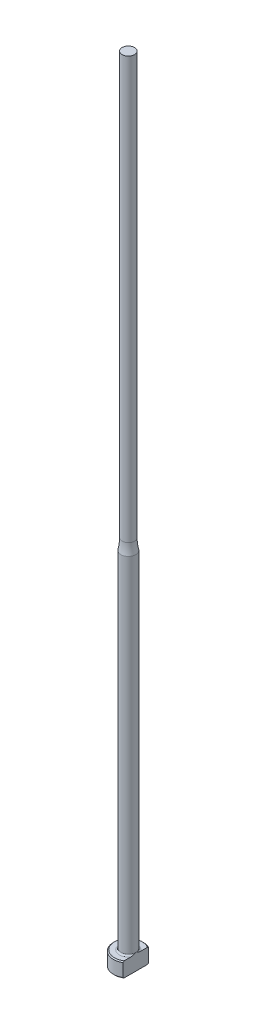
ISO-10303-21;
HEADER;
FILE_DESCRIPTION(('STEP AP214'),'2;1');
FILE_NAME('part.step','',(''),(''),'','','');
FILE_SCHEMA(('AUTOMOTIVE_DESIGN { 1 0 10303 214 1 1 1 1 }'));
ENDSEC;
DATA;
#1=APPLICATION_CONTEXT('core data for automotive mechanical design processes');
#2=APPLICATION_PROTOCOL_DEFINITION('international standard','automotive_design',2000,#1);
#3=PRODUCT_CONTEXT('',#1,'mechanical');
#4=PRODUCT('Part','Part','',(#3));
#5=PRODUCT_RELATED_PRODUCT_CATEGORY('part','',(#4));
#6=PRODUCT_DEFINITION_FORMATION('','',#4);
#7=PRODUCT_DEFINITION_CONTEXT('part definition',#1,'design');
#8=PRODUCT_DEFINITION('design','',#6,#7);
#9=PRODUCT_DEFINITION_SHAPE('','',#8);
#10=(LENGTH_UNIT() NAMED_UNIT(*) SI_UNIT(.MILLI.,.METRE.));
#11=(NAMED_UNIT(*) PLANE_ANGLE_UNIT() SI_UNIT($,.RADIAN.));
#12=(NAMED_UNIT(*) SI_UNIT($,.STERADIAN.) SOLID_ANGLE_UNIT());
#13=UNCERTAINTY_MEASURE_WITH_UNIT(LENGTH_MEASURE(1.E-05),#10,'distance_accuracy_value','');
#14=(GEOMETRIC_REPRESENTATION_CONTEXT(3) GLOBAL_UNCERTAINTY_ASSIGNED_CONTEXT((#13)) GLOBAL_UNIT_ASSIGNED_CONTEXT((#10,
#11,#12)) REPRESENTATION_CONTEXT('',''));
#15=CARTESIAN_POINT('',(0.,0.,0.));
#16=DIRECTION('',(0.,0.,1.));
#17=DIRECTION('',(1.,0.,0.));
#18=AXIS2_PLACEMENT_3D('',#15,#16,#17);
#19=CARTESIAN_POINT('',(-2.99999999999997,3.,0.));
#20=DIRECTION('',(0.,1.,0.));
#21=DIRECTION('',(0.,0.,1.));
#22=AXIS2_PLACEMENT_3D('',#19,#20,#21);
#23=PLANE('',#22);
#24=CARTESIAN_POINT('',(0.,3.,0.));
#25=DIRECTION('',(0.,1.,0.));
#26=DIRECTION('',(0.,0.,1.));
#27=AXIS2_PLACEMENT_3D('',#24,#25,#26);
#28=CIRCLE('',#27,2.79999999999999);
#29=CARTESIAN_POINT('',(1.49999999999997,3.,-2.36431808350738));
#30=VERTEX_POINT('',#29);
#31=CARTESIAN_POINT('',(1.49999999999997,3.,2.36431808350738));
#32=VERTEX_POINT('',#31);
#33=EDGE_CURVE('E187',#30,#32,#28,.T.);
#34=ORIENTED_EDGE('',*,*,#33,.T.);
#35=DIRECTION('',(0.,0.,-1.));
#36=VECTOR('',#35,1.);
#37=CARTESIAN_POINT('',(1.49999999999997,3.,0.));
#38=LINE('',#37,#36);
#39=CARTESIAN_POINT('',(1.49999999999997,3.00000000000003,0.99498743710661));
#40=VERTEX_POINT('',#39);
#41=EDGE_CURVE('E57',#32,#40,#38,.T.);
#42=ORIENTED_EDGE('',*,*,#41,.T.);
#43=CARTESIAN_POINT('',(0.,3.,0.));
#44=DIRECTION('',(0.,1.,0.));
#45=DIRECTION('',(0.,0.,1.));
#46=AXIS2_PLACEMENT_3D('',#43,#44,#45);
#47=CIRCLE('',#46,1.79999999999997);
#48=CARTESIAN_POINT('',(1.49999999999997,3.00000000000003,-0.994987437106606));
#49=VERTEX_POINT('',#48);
#50=EDGE_CURVE('E108',#40,#49,#47,.F.);
#51=ORIENTED_EDGE('',*,*,#50,.T.);
#52=EDGE_CURVE('E137',#49,#30,#38,.T.);
#53=ORIENTED_EDGE('',*,*,#52,.T.);
#54=EDGE_LOOP('',(#34,#42,#51,#53));
#55=FACE_BOUND('',#54,.T.);
#56=ADVANCED_FACE('F32',(#55),#23,.T.);
#57=CARTESIAN_POINT('',(0.,259.958771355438,0.));
#58=DIRECTION('',(0.,1.,0.));
#59=DIRECTION('',(0.,0.,1.));
#60=AXIS2_PLACEMENT_3D('',#57,#58,#59);
#61=CYLINDRICAL_SURFACE('',#60,2.99999999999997);
#62=CARTESIAN_POINT('',(0.,2.80000000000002,0.));
#63=DIRECTION('',(0.,1.,0.));
#64=DIRECTION('',(0.,0.,1.));
#65=AXIS2_PLACEMENT_3D('',#62,#63,#64);
#66=CIRCLE('',#65,2.99999999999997);
#67=CARTESIAN_POINT('',(1.49999999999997,2.80000000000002,2.5980762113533));
#68=VERTEX_POINT('',#67);
#69=CARTESIAN_POINT('',(1.49999999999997,2.80000000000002,-2.5980762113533));
#70=VERTEX_POINT('',#69);
#71=EDGE_CURVE('E105',#68,#70,#66,.F.);
#72=ORIENTED_EDGE('',*,*,#71,.T.);
#73=DIRECTION('',(0.,-1.,0.));
#74=VECTOR('',#73,1.);
#75=CARTESIAN_POINT('',(1.49999999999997,160.,-2.5980762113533));
#76=LINE('',#75,#74);
#77=CARTESIAN_POINT('',(1.49999999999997,0.200000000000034,-2.5980762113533));
#78=VERTEX_POINT('',#77);
#79=EDGE_CURVE('E193',#70,#78,#76,.T.);
#80=ORIENTED_EDGE('',*,*,#79,.T.);
#81=CARTESIAN_POINT('',(0.,0.200000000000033,0.));
#82=DIRECTION('',(0.,-1.,0.));
#83=DIRECTION('',(0.,0.,-1.));
#84=AXIS2_PLACEMENT_3D('',#81,#82,#83);
#85=CIRCLE('',#84,2.99999999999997);
#86=CARTESIAN_POINT('',(1.49999999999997,0.200000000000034,2.5980762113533));
#87=VERTEX_POINT('',#86);
#88=EDGE_CURVE('E100',#78,#87,#85,.F.);
#89=ORIENTED_EDGE('',*,*,#88,.T.);
#90=DIRECTION('',(0.,-1.,0.));
#91=VECTOR('',#90,1.);
#92=CARTESIAN_POINT('',(1.49999999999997,160.,2.5980762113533));
#93=LINE('',#92,#91);
#94=EDGE_CURVE('E93',#68,#87,#93,.T.);
#95=ORIENTED_EDGE('',*,*,#94,.F.);
#96=EDGE_LOOP('',(#72,#80,#89,#95));
#97=FACE_BOUND('',#96,.T.);
#98=ADVANCED_FACE('F158',(#97),#61,.T.);
#99=CARTESIAN_POINT('',(0.,0.,0.));
#100=DIRECTION('',(0.,-1.,0.));
#101=DIRECTION('',(0.,0.,-1.));
#102=AXIS2_PLACEMENT_3D('',#99,#100,#101);
#103=PLANE('',#102);
#104=CARTESIAN_POINT('',(0.,0.,0.));
#105=DIRECTION('',(0.,-1.,0.));
#106=DIRECTION('',(0.,0.,-1.));
#107=AXIS2_PLACEMENT_3D('',#104,#105,#106);
#108=CIRCLE('',#107,2.79999999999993);
#109=CARTESIAN_POINT('',(1.49999999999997,0.,2.36431808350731));
#110=VERTEX_POINT('',#109);
#111=CARTESIAN_POINT('',(1.49999999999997,0.,-2.36431808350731));
#112=VERTEX_POINT('',#111);
#113=EDGE_CURVE('E98',#110,#112,#108,.T.);
#114=ORIENTED_EDGE('',*,*,#113,.T.);
#115=DIRECTION('',(0.,0.,1.));
#116=VECTOR('',#115,1.);
#117=CARTESIAN_POINT('',(1.49999999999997,0.,-2.5980762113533));
#118=LINE('',#117,#116);
#119=EDGE_CURVE('E83',#112,#110,#118,.T.);
#120=ORIENTED_EDGE('',*,*,#119,.T.);
#121=EDGE_LOOP('',(#114,#120));
#122=FACE_BOUND('',#121,.T.);
#123=ADVANCED_FACE('F103',(#122),#103,.T.);
#124=CARTESIAN_POINT('',(0.,3.,0.));
#125=DIRECTION('',(0.,-1.,0.));
#126=DIRECTION('',(0.,0.,-1.));
#127=AXIS2_PLACEMENT_3D('',#124,#125,#126);
#128=CONICAL_SURFACE('',#127,2.79999999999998,0.785398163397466);
#129=ORIENTED_EDGE('',*,*,#71,.F.);
#130=CARTESIAN_POINT('',(1.49999999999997,-0.111741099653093,5.71827621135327));
#131=CARTESIAN_POINT('',(1.49999999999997,0.0136183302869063,5.58866816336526));
#132=CARTESIAN_POINT('',(1.49999999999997,0.138843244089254,5.45892957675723));
#133=CARTESIAN_POINT('',(1.49999999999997,0.388944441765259,5.19911365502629));
#134=CARTESIAN_POINT('',(1.49999999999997,0.513820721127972,5.06903631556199));
#135=CARTESIAN_POINT('',(1.49999999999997,0.763205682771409,4.80840180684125));
#136=CARTESIAN_POINT('',(1.49999999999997,0.887714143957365,4.67784442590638));
#137=CARTESIAN_POINT('',(1.49999999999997,1.13618059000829,4.41620813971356));
#138=CARTESIAN_POINT('',(1.49999999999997,1.26013857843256,4.28512923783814));
#139=CARTESIAN_POINT('',(1.49999999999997,1.50488975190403,4.02490837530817));
#140=CARTESIAN_POINT('',(1.49999999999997,1.6256969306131,3.89577958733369));
#141=CARTESIAN_POINT('',(1.49999999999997,1.86640694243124,3.63668213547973));
#142=CARTESIAN_POINT('',(1.49999999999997,1.98630978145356,3.50671347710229));
#143=CARTESIAN_POINT('',(1.49999999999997,2.22486033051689,3.24567921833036));
#144=CARTESIAN_POINT('',(1.49999999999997,2.34350830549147,3.11461386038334));
#145=CARTESIAN_POINT('',(1.49999999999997,2.57907716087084,2.85094268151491));
#146=CARTESIAN_POINT('',(1.49999999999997,2.69599811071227,2.71833692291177));
#147=CARTESIAN_POINT('',(1.49999999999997,2.88262371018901,2.50255231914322));
#148=CARTESIAN_POINT('',(1.49999999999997,2.95312454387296,2.42006293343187));
#149=CARTESIAN_POINT('',(1.49999999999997,3.0928709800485,2.25401084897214));
#150=CARTESIAN_POINT('',(1.49999999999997,3.16211645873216,2.17044804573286));
#151=CARTESIAN_POINT('',(1.49999999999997,3.29964684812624,2.00105967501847));
#152=CARTESIAN_POINT('',(1.49999999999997,3.36791386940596,1.91521952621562));
#153=CARTESIAN_POINT('',(1.49999999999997,3.50205840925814,1.74171392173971));
#154=CARTESIAN_POINT('',(1.49999999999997,3.56793649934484,1.65404891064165));
#155=CARTESIAN_POINT('',(1.49999999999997,3.69728151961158,1.47490236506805));
#156=CARTESIAN_POINT('',(1.49999999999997,3.76069661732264,1.38338308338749));
#157=CARTESIAN_POINT('',(1.49999999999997,3.8823953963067,1.19675661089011));
#158=CARTESIAN_POINT('',(1.49999999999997,3.94067201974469,1.10164473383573));
#159=CARTESIAN_POINT('',(1.49999999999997,4.04841325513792,0.908008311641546));
#160=CARTESIAN_POINT('',(1.49999999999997,4.0979780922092,0.809540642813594));
#161=CARTESIAN_POINT('',(1.49999999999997,4.18432188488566,0.607192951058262));
#162=CARTESIAN_POINT('',(1.49999999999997,4.22114374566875,0.503332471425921));
#163=CARTESIAN_POINT('',(1.49999999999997,4.26099935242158,0.347577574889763));
#164=CARTESIAN_POINT('',(1.49999999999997,4.27157029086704,0.297609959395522));
#165=CARTESIAN_POINT('',(1.49999999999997,4.28794860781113,0.196885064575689));
#166=CARTESIAN_POINT('',(1.49999999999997,4.29375640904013,0.146127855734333));
#167=CARTESIAN_POINT('',(1.49999999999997,4.30019707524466,0.0444388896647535));
#168=CARTESIAN_POINT('',(1.49999999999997,4.30084594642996,-0.00649183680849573));
#169=CARTESIAN_POINT('',(1.49999999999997,4.29696416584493,-0.108155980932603));
#170=CARTESIAN_POINT('',(1.49999999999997,4.29243308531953,-0.15888938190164));
#171=CARTESIAN_POINT('',(1.49999999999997,4.27856915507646,-0.259234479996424));
#172=CARTESIAN_POINT('',(1.49999999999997,4.26927821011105,-0.30885208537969));
#173=CARTESIAN_POINT('',(1.49999999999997,4.24647108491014,-0.407110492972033));
#174=CARTESIAN_POINT('',(1.49999999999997,4.2329532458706,-0.455750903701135));
#175=CARTESIAN_POINT('',(1.49999999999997,4.20226175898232,-0.552149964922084));
#176=CARTESIAN_POINT('',(1.49999999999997,4.18506801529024,-0.599902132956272));
#177=CARTESIAN_POINT('',(1.49999999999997,4.14771387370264,-0.694205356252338));
#178=CARTESIAN_POINT('',(1.49999999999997,4.1275540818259,-0.740756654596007));
#179=CARTESIAN_POINT('',(1.49999999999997,4.06327696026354,-0.879166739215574));
#180=CARTESIAN_POINT('',(1.49999999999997,4.01551721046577,-0.969329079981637));
#181=CARTESIAN_POINT('',(1.49999999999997,3.91367909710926,-1.1460431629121));
#182=CARTESIAN_POINT('',(1.49999999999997,3.85959300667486,-1.23259031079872));
#183=CARTESIAN_POINT('',(1.49999999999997,3.74697968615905,-1.40321348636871));
#184=CARTESIAN_POINT('',(1.49999999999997,3.68843573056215,-1.48727838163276));
#185=CARTESIAN_POINT('',(1.49999999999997,3.56843845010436,-1.65322187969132));
#186=CARTESIAN_POINT('',(1.49999999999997,3.50698656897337,-1.73510153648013));
#187=CARTESIAN_POINT('',(1.49999999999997,3.38115673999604,-1.89829823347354));
#188=CARTESIAN_POINT('',(1.49999999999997,3.31675092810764,-1.97959369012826));
#189=CARTESIAN_POINT('',(1.49999999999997,3.18634068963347,-2.14090082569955));
#190=CARTESIAN_POINT('',(1.49999999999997,3.12033609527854,-2.22091236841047));
#191=CARTESIAN_POINT('',(1.49999999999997,2.92086431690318,-2.45906508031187));
#192=CARTESIAN_POINT('',(1.49999999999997,2.78562663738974,-2.61572090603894));
#193=CARTESIAN_POINT('',(1.49999999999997,2.53554498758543,-2.90006295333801));
#194=CARTESIAN_POINT('',(1.49999999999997,2.42114543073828,-3.02814382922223));
#195=CARTESIAN_POINT('',(1.49999999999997,2.19093557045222,-3.28303767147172));
#196=CARTESIAN_POINT('',(1.49999999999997,2.07512522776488,-3.40985060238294));
#197=CARTESIAN_POINT('',(1.49999999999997,1.72597067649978,-3.7891384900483));
#198=CARTESIAN_POINT('',(1.49999999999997,1.49111760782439,-4.04022177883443));
#199=CARTESIAN_POINT('',(1.49999999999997,1.02882478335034,-4.52992803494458));
#200=CARTESIAN_POINT('',(1.49999999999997,0.801477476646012,-4.76863870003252));
#201=CARTESIAN_POINT('',(1.49999999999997,0.459548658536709,-5.12558036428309));
#202=CARTESIAN_POINT('',(1.49999999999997,0.345484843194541,-5.2443077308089));
#203=CARTESIAN_POINT('',(1.49999999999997,0.117071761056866,-5.48148573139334));
#204=CARTESIAN_POINT('',(1.49999999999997,0.00272249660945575,-5.59993636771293));
#205=CARTESIAN_POINT('',(1.49999999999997,-0.111741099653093,-5.71827621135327));
#206=B_SPLINE_CURVE_WITH_KNOTS('',3,(#130,#131,#132,#133,#134,#135,#136,#137,#138,#139,#140,
#141,#142,#143,#144,#145,#146,#147,#148,#149,#150,#151,#152,#153,#154,#155,#156,#157,#158,#159,
#160,#161,#162,#163,#164,#165,#166,#167,#168,#169,#170,#171,#172,#173,#174,#175,#176,#177,#178,
#179,#180,#181,#182,#183,#184,#185,#186,#187,#188,#189,#190,#191,#192,#193,#194,#195,#196,#197,
#198,#199,#200,#201,#202,#203,#204,#205),.UNSPECIFIED.,.F.,.F.,(4,2,2,2,2,2,2,2,2,2,2,2,2,2,2,2,
2,2,2,2,2,2,2,2,2,2,2,2,2,2,2,2,2,2,2,2,2,4),(0.,0.540943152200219,1.08189327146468,
1.62312052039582,2.16434426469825,2.69482920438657,3.22531067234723,3.75567781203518,
4.2860235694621,4.61155053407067,4.93710943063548,5.2661094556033,5.59503024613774,
5.92894782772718,6.26331713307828,6.59354403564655,6.92264800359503,7.0756747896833,
7.22868799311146,7.38122626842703,7.53377717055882,7.68500755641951,7.83629736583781,
7.98843643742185,8.14054446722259,8.44618799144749,8.75220879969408,9.05944044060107,
9.36652111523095,9.67764287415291,9.98879742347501,10.6095925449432,11.1247803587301,
11.6399825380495,12.6713544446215,13.6603005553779,14.1542238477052,14.6481430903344),.UNSPECIFIED.);
#207=EDGE_CURVE('E136',#68,#32,#206,.T.);
#208=ORIENTED_EDGE('',*,*,#207,.T.);
#209=ORIENTED_EDGE('',*,*,#33,.F.);
#210=EDGE_CURVE('E128',#30,#70,#206,.T.);
#211=ORIENTED_EDGE('',*,*,#210,.T.);
#212=EDGE_LOOP('',(#129,#208,#209,#211));
#213=FACE_BOUND('',#212,.T.);
#214=ADVANCED_FACE('F144',(#213),#128,.T.);
#215=CARTESIAN_POINT('',(0.,0.200000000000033,0.));
#216=DIRECTION('',(0.,1.,0.));
#217=DIRECTION('',(0.,0.,1.));
#218=AXIS2_PLACEMENT_3D('',#215,#216,#217);
#219=CONICAL_SURFACE('',#218,2.99999999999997,0.785398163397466);
#220=ORIENTED_EDGE('',*,*,#88,.F.);
#221=CARTESIAN_POINT('',(1.49999999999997,3.11174109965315,-5.71827621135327));
#222=CARTESIAN_POINT('',(1.49999999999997,2.98638166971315,-5.58866816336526));
#223=CARTESIAN_POINT('',(1.49999999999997,2.8611567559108,-5.45892957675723));
#224=CARTESIAN_POINT('',(1.49999999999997,2.6110555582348,-5.19911365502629));
#225=CARTESIAN_POINT('',(1.49999999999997,2.48617927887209,-5.06903631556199));
#226=CARTESIAN_POINT('',(1.49999999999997,2.23679431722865,-4.80840180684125));
#227=CARTESIAN_POINT('',(1.49999999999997,2.11228585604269,-4.67784442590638));
#228=CARTESIAN_POINT('',(1.49999999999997,1.86381940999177,-4.41620813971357));
#229=CARTESIAN_POINT('',(1.49999999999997,1.7398614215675,-4.28512923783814));
#230=CARTESIAN_POINT('',(1.49999999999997,1.49511024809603,-4.02490837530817));
#231=CARTESIAN_POINT('',(1.49999999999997,1.37430306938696,-3.89577958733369));
#232=CARTESIAN_POINT('',(1.49999999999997,1.13359305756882,-3.63668213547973));
#233=CARTESIAN_POINT('',(1.49999999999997,1.0136902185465,-3.50671347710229));
#234=CARTESIAN_POINT('',(1.49999999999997,0.775139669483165,-3.24567921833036));
#235=CARTESIAN_POINT('',(1.49999999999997,0.656491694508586,-3.11461386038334));
#236=CARTESIAN_POINT('',(1.49999999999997,0.420922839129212,-2.85094268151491));
#237=CARTESIAN_POINT('',(1.49999999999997,0.304001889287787,-2.71833692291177));
#238=CARTESIAN_POINT('',(1.49999999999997,0.117376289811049,-2.50255231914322));
#239=CARTESIAN_POINT('',(1.49999999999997,0.0468754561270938,-2.42006293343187));
#240=CARTESIAN_POINT('',(1.49999999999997,-0.0928709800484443,-2.25401084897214));
#241=CARTESIAN_POINT('',(1.49999999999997,-0.162116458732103,-2.17044804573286));
#242=CARTESIAN_POINT('',(1.49999999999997,-0.299646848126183,-2.00105967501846));
#243=CARTESIAN_POINT('',(1.49999999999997,-0.367913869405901,-1.91521952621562));
#244=CARTESIAN_POINT('',(1.49999999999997,-0.502058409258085,-1.74171392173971));
#245=CARTESIAN_POINT('',(1.49999999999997,-0.567936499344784,-1.65404891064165));
#246=CARTESIAN_POINT('',(1.49999999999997,-0.697281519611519,-1.47490236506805));
#247=CARTESIAN_POINT('',(1.49999999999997,-0.760696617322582,-1.38338308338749));
#248=CARTESIAN_POINT('',(1.49999999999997,-0.882395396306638,-1.19675661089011));
#249=CARTESIAN_POINT('',(1.49999999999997,-0.940672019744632,-1.10164473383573));
#250=CARTESIAN_POINT('',(1.49999999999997,-1.04841325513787,-0.908008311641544));
#251=CARTESIAN_POINT('',(1.49999999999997,-1.09797809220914,-0.809540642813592));
#252=CARTESIAN_POINT('',(1.49999999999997,-1.1843218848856,-0.60719295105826));
#253=CARTESIAN_POINT('',(1.49999999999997,-1.22114374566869,-0.503332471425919));
#254=CARTESIAN_POINT('',(1.49999999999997,-1.26099935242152,-0.347577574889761));
#255=CARTESIAN_POINT('',(1.49999999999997,-1.27157029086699,-0.29760995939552));
#256=CARTESIAN_POINT('',(1.49999999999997,-1.28794860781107,-0.196885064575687));
#257=CARTESIAN_POINT('',(1.49999999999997,-1.29375640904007,-0.146127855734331));
#258=CARTESIAN_POINT('',(1.49999999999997,-1.30019707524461,-0.0444388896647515));
#259=CARTESIAN_POINT('',(1.49999999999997,-1.3008459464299,0.00649183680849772));
#260=CARTESIAN_POINT('',(1.49999999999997,-1.29696416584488,0.108155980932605));
#261=CARTESIAN_POINT('',(1.49999999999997,-1.29243308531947,0.158889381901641));
#262=CARTESIAN_POINT('',(1.49999999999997,-1.2785691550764,0.259234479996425));
#263=CARTESIAN_POINT('',(1.49999999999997,-1.26927821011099,0.308852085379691));
#264=CARTESIAN_POINT('',(1.49999999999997,-1.24647108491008,0.407110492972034));
#265=CARTESIAN_POINT('',(1.49999999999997,-1.23295324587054,0.455750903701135));
#266=CARTESIAN_POINT('',(1.49999999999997,-1.20226175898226,0.552149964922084));
#267=CARTESIAN_POINT('',(1.49999999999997,-1.18506801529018,0.599902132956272));
#268=CARTESIAN_POINT('',(1.49999999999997,-1.14771387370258,0.694205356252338));
#269=CARTESIAN_POINT('',(1.49999999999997,-1.12755408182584,0.740756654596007));
#270=CARTESIAN_POINT('',(1.49999999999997,-1.06327696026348,0.879166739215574));
#271=CARTESIAN_POINT('',(1.49999999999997,-1.01551721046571,0.969329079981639));
#272=CARTESIAN_POINT('',(1.49999999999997,-0.913679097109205,1.1460431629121));
#273=CARTESIAN_POINT('',(1.49999999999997,-0.8595930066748,1.23259031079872));
#274=CARTESIAN_POINT('',(1.49999999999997,-0.746979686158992,1.40321348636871));
#275=CARTESIAN_POINT('',(1.49999999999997,-0.688435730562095,1.48727838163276));
#276=CARTESIAN_POINT('',(1.49999999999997,-0.568438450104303,1.65322187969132));
#277=CARTESIAN_POINT('',(1.49999999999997,-0.506986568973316,1.73510153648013));
#278=CARTESIAN_POINT('',(1.49999999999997,-0.381156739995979,1.89829823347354));
#279=CARTESIAN_POINT('',(1.49999999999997,-0.316750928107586,1.97959369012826));
#280=CARTESIAN_POINT('',(1.49999999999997,-0.186340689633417,2.14090082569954));
#281=CARTESIAN_POINT('',(1.49999999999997,-0.120336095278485,2.22091236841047));
#282=CARTESIAN_POINT('',(1.49999999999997,0.0791356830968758,2.45906508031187));
#283=CARTESIAN_POINT('',(1.49999999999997,0.214373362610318,2.61572090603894));
#284=CARTESIAN_POINT('',(1.49999999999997,0.46445501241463,2.90006295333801));
#285=CARTESIAN_POINT('',(1.49999999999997,0.578854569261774,3.02814382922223));
#286=CARTESIAN_POINT('',(1.49999999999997,0.809064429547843,3.28303767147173));
#287=CARTESIAN_POINT('',(1.49999999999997,0.924874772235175,3.40985060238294));
#288=CARTESIAN_POINT('',(1.49999999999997,1.27402932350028,3.78913849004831));
#289=CARTESIAN_POINT('',(1.49999999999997,1.50888239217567,4.04022177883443));
#290=CARTESIAN_POINT('',(1.49999999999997,1.97117521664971,4.52992803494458));
#291=CARTESIAN_POINT('',(1.49999999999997,2.19852252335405,4.76863870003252));
#292=CARTESIAN_POINT('',(1.49999999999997,2.54045134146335,5.12558036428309));
#293=CARTESIAN_POINT('',(1.49999999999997,2.65451515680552,5.2443077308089));
#294=CARTESIAN_POINT('',(1.49999999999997,2.88292823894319,5.48148573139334));
#295=CARTESIAN_POINT('',(1.49999999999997,2.9972775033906,5.59993636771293));
#296=CARTESIAN_POINT('',(1.49999999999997,3.11174109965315,5.71827621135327));
#297=B_SPLINE_CURVE_WITH_KNOTS('',3,(#221,#222,#223,#224,#225,#226,#227,#228,#229,#230,#231,
#232,#233,#234,#235,#236,#237,#238,#239,#240,#241,#242,#243,#244,#245,#246,#247,#248,#249,#250,
#251,#252,#253,#254,#255,#256,#257,#258,#259,#260,#261,#262,#263,#264,#265,#266,#267,#268,#269,
#270,#271,#272,#273,#274,#275,#276,#277,#278,#279,#280,#281,#282,#283,#284,#285,#286,#287,#288,
#289,#290,#291,#292,#293,#294,#295,#296),.UNSPECIFIED.,.F.,.F.,(4,2,2,2,2,2,2,2,2,2,2,2,2,2,2,2,
2,2,2,2,2,2,2,2,2,2,2,2,2,2,2,2,2,2,2,2,2,4),(0.,0.540943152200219,1.08189327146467,
1.62312052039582,2.16434426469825,2.69482920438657,3.22531067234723,3.75567781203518,
4.28602356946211,4.61155053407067,4.93710943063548,5.2661094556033,5.59503024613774,
5.92894782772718,6.26331713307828,6.59354403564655,6.92264800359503,7.0756747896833,
7.22868799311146,7.38122626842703,7.53377717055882,7.68500755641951,7.83629736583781,
7.98843643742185,8.14054446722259,8.4461879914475,8.75220879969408,9.05944044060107,
9.36652111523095,9.6776428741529,9.98879742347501,10.6095925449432,11.1247803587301,
11.6399825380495,12.6713544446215,13.6603005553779,14.1542238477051,14.6481430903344),.UNSPECIFIED.);
#298=EDGE_CURVE('E86',#78,#112,#297,.T.);
#299=ORIENTED_EDGE('',*,*,#298,.T.);
#300=ORIENTED_EDGE('',*,*,#113,.F.);
#301=EDGE_CURVE('E89',#110,#87,#297,.T.);
#302=ORIENTED_EDGE('',*,*,#301,.T.);
#303=EDGE_LOOP('',(#220,#299,#300,#302));
#304=FACE_BOUND('',#303,.T.);
#305=ADVANCED_FACE('F97',(#304),#219,.T.);
#306=CARTESIAN_POINT('',(0.,3.30000000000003,0.));
#307=DIRECTION('',(0.,1.,0.));
#308=DIRECTION('',(0.,0.,1.));
#309=AXIS2_PLACEMENT_3D('',#306,#307,#308);
#310=TOROIDAL_SURFACE('',#309,1.79999999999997,0.3);
#311=CARTESIAN_POINT('',(1.49999999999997,3.30000000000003,0.));
#312=CARTESIAN_POINT('',(1.49999999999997,3.300000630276,3.41555678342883E-12));
#313=CARTESIAN_POINT('',(1.49999999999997,3.30000126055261,-1.15373640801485E-07));
#314=CARTESIAN_POINT('',(1.49999999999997,3.3000024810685,-4.90631575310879E-07));
#315=CARTESIAN_POINT('',(1.49999999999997,3.30000307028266,-7.53296670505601E-07));
#316=CARTESIAN_POINT('',(1.49999999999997,3.30000424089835,-1.38757096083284E-06));
#317=CARTESIAN_POINT('',(1.49999999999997,3.300004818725,-1.76563001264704E-06));
#318=CARTESIAN_POINT('',(1.49999999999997,3.30000591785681,-2.58768006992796E-06));
#319=CARTESIAN_POINT('',(1.49999999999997,3.30000643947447,-3.03127014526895E-06));
#320=CARTESIAN_POINT('',(1.49999999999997,3.30000815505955,-4.60021967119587E-06));
#321=CARTESIAN_POINT('',(1.49999999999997,3.30000927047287,-5.8124152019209E-06));
#322=CARTESIAN_POINT('',(1.49999999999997,3.30001128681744,-8.33989413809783E-06));
#323=CARTESIAN_POINT('',(1.49999999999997,3.30001219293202,-9.65128157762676E-06));
#324=CARTESIAN_POINT('',(1.49999999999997,3.30001551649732,-1.46782505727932E-05));
#325=CARTESIAN_POINT('',(1.49999999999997,3.30001775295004,-1.8517976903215E-05));
#326=CARTESIAN_POINT('',(1.49999999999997,3.30002148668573,-2.61616194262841E-05));
#327=CARTESIAN_POINT('',(1.49999999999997,3.30002302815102,-2.99447742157E-05));
#328=CARTESIAN_POINT('',(1.49999999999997,3.30002943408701,-4.58003743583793E-05));
#329=CARTESIAN_POINT('',(1.49999999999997,3.3000341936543,-5.79079078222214E-05));
#330=CARTESIAN_POINT('',(1.49999999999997,3.30004197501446,-8.07263755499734E-05));
#331=CARTESIAN_POINT('',(1.49999999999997,3.30004514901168,-9.13834709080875E-05));
#332=CARTESIAN_POINT('',(1.49999999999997,3.30006989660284,-0.000167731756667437));
#333=CARTESIAN_POINT('',(1.49999999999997,3.30010092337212,-0.000229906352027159));
#334=CARTESIAN_POINT('',(1.49999999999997,3.30021632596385,-0.000470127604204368));
#335=CARTESIAN_POINT('',(1.49999999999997,3.30029368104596,-0.000650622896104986));
#336=CARTESIAN_POINT('',(1.49999999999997,3.30059619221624,-0.00134589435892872));
#337=CARTESIAN_POINT('',(1.49999999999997,3.30082870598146,-0.00185814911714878));
#338=CARTESIAN_POINT('',(1.49999999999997,3.30176696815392,-0.00393547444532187));
#339=CARTESIAN_POINT('',(1.49999999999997,3.30246445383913,-0.00550332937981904));
#340=CARTESIAN_POINT('',(1.49999999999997,3.31426785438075,-0.0320229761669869));
#341=CARTESIAN_POINT('',(1.49999999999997,3.32544800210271,-0.0569503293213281));
#342=CARTESIAN_POINT('',(1.49999999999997,3.34725700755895,-0.105984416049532));
#343=CARTESIAN_POINT('',(1.49999999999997,3.35789134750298,-0.130088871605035));
#344=CARTESIAN_POINT('',(1.49999999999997,3.38015321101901,-0.181096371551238));
#345=CARTESIAN_POINT('',(1.49999999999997,3.39175804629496,-0.208009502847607));
#346=CARTESIAN_POINT('',(1.49999999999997,3.41469034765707,-0.262264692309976));
#347=CARTESIAN_POINT('',(1.49999999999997,3.42601398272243,-0.289608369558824));
#348=CARTESIAN_POINT('',(1.49999999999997,3.45363212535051,-0.35820378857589));
#349=CARTESIAN_POINT('',(1.49999999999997,3.46959026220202,-0.39959288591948));
#350=CARTESIAN_POINT('',(1.49999999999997,3.49940505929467,-0.482097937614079));
#351=CARTESIAN_POINT('',(1.49999999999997,3.51330033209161,-0.523199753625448));
#352=CARTESIAN_POINT('',(1.49999999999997,3.53552507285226,-0.595497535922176));
#353=CARTESIAN_POINT('',(1.49999999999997,3.54436834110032,-0.626532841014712));
#354=CARTESIAN_POINT('',(1.49999999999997,3.56052427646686,-0.6891760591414));
#355=CARTESIAN_POINT('',(1.49999999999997,3.5678279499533,-0.720786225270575));
#356=CARTESIAN_POINT('',(1.49999999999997,3.5875075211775,-0.819524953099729));
#357=CARTESIAN_POINT('',(1.49999999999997,3.59661044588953,-0.88742909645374));
#358=CARTESIAN_POINT('',(1.49999999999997,3.60059842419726,-0.991180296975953));
#359=CARTESIAN_POINT('',(1.49999999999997,3.60019840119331,-1.02684364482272));
#360=CARTESIAN_POINT('',(1.49999999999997,3.59497085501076,-1.097505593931));
#361=CARTESIAN_POINT('',(1.49999999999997,3.59019295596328,-1.13250716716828));
#362=CARTESIAN_POINT('',(1.49999999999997,3.57687734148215,-1.19353096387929));
#363=CARTESIAN_POINT('',(1.49999999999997,3.56943875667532,-1.21978854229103));
#364=CARTESIAN_POINT('',(1.49999999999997,3.55063748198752,-1.27094658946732));
#365=CARTESIAN_POINT('',(1.49999999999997,3.53927342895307,-1.29584658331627));
#366=CARTESIAN_POINT('',(1.49999999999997,3.51660016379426,-1.33501873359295));
#367=CARTESIAN_POINT('',(1.49999999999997,3.50657738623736,-1.35003296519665));
#368=CARTESIAN_POINT('',(1.49999999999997,3.48437469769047,-1.37837252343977));
#369=CARTESIAN_POINT('',(1.49999999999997,3.47219867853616,-1.39170082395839));
#370=CARTESIAN_POINT('',(1.49999999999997,3.44835614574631,-1.41349417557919));
#371=CARTESIAN_POINT('',(1.49999999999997,3.43709185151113,-1.42239673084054));
#372=CARTESIAN_POINT('',(1.49999999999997,3.41325256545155,-1.43825467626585));
#373=CARTESIAN_POINT('',(1.49999999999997,3.40067804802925,-1.44521076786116));
#374=CARTESIAN_POINT('',(1.49999999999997,3.37433767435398,-1.45677158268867));
#375=CARTESIAN_POINT('',(1.49999999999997,3.36056203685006,-1.46135438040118));
#376=CARTESIAN_POINT('',(1.49999999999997,3.33237324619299,-1.46767730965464));
#377=CARTESIAN_POINT('',(1.49999999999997,3.31796076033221,-1.46942034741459));
#378=CARTESIAN_POINT('',(1.49999999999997,3.29122479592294,-1.4698720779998));
#379=CARTESIAN_POINT('',(1.49999999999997,3.27890664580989,-1.468990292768));
#380=CARTESIAN_POINT('',(1.49999999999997,3.25461019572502,-1.4651157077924));
#381=CARTESIAN_POINT('',(1.49999999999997,3.2426318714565,-1.46212305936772));
#382=CARTESIAN_POINT('',(1.49999999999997,3.21959683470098,-1.4543117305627));
#383=CARTESIAN_POINT('',(1.49999999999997,3.20852542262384,-1.44953579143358));
#384=CARTESIAN_POINT('',(1.49999999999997,3.18721125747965,-1.43840957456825));
#385=CARTESIAN_POINT('',(1.49999999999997,3.1769687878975,-1.43205876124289));
#386=CARTESIAN_POINT('',(1.49999999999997,3.15325976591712,-1.41506353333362));
#387=CARTESIAN_POINT('',(1.49999999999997,3.14027750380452,-1.40374235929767));
#388=CARTESIAN_POINT('',(1.49999999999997,3.11630720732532,-1.37914825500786));
#389=CARTESIAN_POINT('',(1.49999999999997,3.10532420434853,-1.36587054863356));
#390=CARTESIAN_POINT('',(1.49999999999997,3.08100891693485,-1.33197272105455));
#391=CARTESIAN_POINT('',(1.49999999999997,3.06867625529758,-1.31063843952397));
#392=CARTESIAN_POINT('',(1.49999999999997,3.04751867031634,-1.26637455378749));
#393=CARTESIAN_POINT('',(1.49999999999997,3.03869240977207,-1.24344556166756));
#394=CARTESIAN_POINT('',(1.49999999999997,3.01978360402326,-1.18316534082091));
#395=CARTESIAN_POINT('',(1.49999999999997,3.01191472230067,-1.14512623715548));
#396=CARTESIAN_POINT('',(1.49999999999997,3.00188285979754,-1.06789971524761));
#397=CARTESIAN_POINT('',(1.49999999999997,2.99979735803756,-1.02870374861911));
#398=CARTESIAN_POINT('',(1.49999999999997,3.00021727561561,-0.953160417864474));
#399=CARTESIAN_POINT('',(1.49999999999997,3.00240673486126,-0.916808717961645));
#400=CARTESIAN_POINT('',(1.49999999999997,3.0099643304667,-0.844432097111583));
#401=CARTESIAN_POINT('',(1.49999999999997,3.01533462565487,-0.808407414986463));
#402=CARTESIAN_POINT('',(1.49999999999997,3.02828086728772,-0.738670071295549));
#403=CARTESIAN_POINT('',(1.49999999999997,3.03573028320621,-0.704933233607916));
#404=CARTESIAN_POINT('',(1.49999999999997,3.05243174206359,-0.638128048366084));
#405=CARTESIAN_POINT('',(1.49999999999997,3.06167285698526,-0.605056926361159));
#406=CARTESIAN_POINT('',(1.49999999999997,3.08440652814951,-0.53019513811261));
#407=CARTESIAN_POINT('',(1.49999999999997,3.09836576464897,-0.488547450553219));
#408=CARTESIAN_POINT('',(1.49999999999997,3.1283820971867,-0.404954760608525));
#409=CARTESIAN_POINT('',(1.49999999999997,3.14447968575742,-0.363024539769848));
#410=CARTESIAN_POINT('',(1.49999999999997,3.17238454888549,-0.293508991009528));
#411=CARTESIAN_POINT('',(1.49999999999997,3.18384249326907,-0.265781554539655));
#412=CARTESIAN_POINT('',(1.49999999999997,3.20705854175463,-0.210769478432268));
#413=CARTESIAN_POINT('',(1.49999999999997,3.21881265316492,-0.183483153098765));
#414=CARTESIAN_POINT('',(1.49999999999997,3.24136702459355,-0.131772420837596));
#415=CARTESIAN_POINT('',(1.49999999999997,3.25214361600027,-0.107337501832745));
#416=CARTESIAN_POINT('',(1.49999999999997,3.27424746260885,-0.0576321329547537));
#417=CARTESIAN_POINT('',(1.49999999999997,3.28558038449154,-0.0323640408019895));
#418=CARTESIAN_POINT('',(1.49999999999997,3.29753556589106,-0.00550327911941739));
#419=CARTESIAN_POINT('',(1.49999999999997,3.29823307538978,-0.00393537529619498));
#420=CARTESIAN_POINT('',(1.49999999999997,3.29917134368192,-0.00185803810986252));
#421=CARTESIAN_POINT('',(1.49999999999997,3.29940384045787,-0.00134582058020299));
#422=CARTESIAN_POINT('',(1.49999999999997,3.29970633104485,-0.000650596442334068));
#423=CARTESIAN_POINT('',(1.49999999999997,3.29978368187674,-0.000470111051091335));
#424=CARTESIAN_POINT('',(1.49999999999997,3.29989907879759,-0.000229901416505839));
#425=CARTESIAN_POINT('',(1.49999999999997,3.29993010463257,-0.000167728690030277));
#426=CARTESIAN_POINT('',(1.49999999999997,3.29995485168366,-9.13825689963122E-05));
#427=CARTESIAN_POINT('',(1.49999999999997,3.29995802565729,-8.07256241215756E-05));
#428=CARTESIAN_POINT('',(1.49999999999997,3.29996580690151,-5.79074820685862E-05));
#429=CARTESIAN_POINT('',(1.49999999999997,3.29997056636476,-4.5800119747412E-05));
#430=CARTESIAN_POINT('',(1.49999999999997,3.29997697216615,-2.99447119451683E-05));
#431=CARTESIAN_POINT('',(1.49999999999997,3.2999785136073,-2.61615817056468E-05));
#432=CARTESIAN_POINT('',(1.49999999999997,3.2999822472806,-1.85179845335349E-05));
#433=CARTESIAN_POINT('',(1.49999999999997,3.29998448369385,-1.46782782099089E-05));
#434=CARTESIAN_POINT('',(1.49999999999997,3.2999878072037,-9.65132752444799E-06));
#435=CARTESIAN_POINT('',(1.49999999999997,3.299988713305,-8.33994202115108E-06));
#436=CARTESIAN_POINT('',(1.49999999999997,3.29999072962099,-5.81246426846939E-06));
#437=CARTESIAN_POINT('',(1.49999999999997,3.29999184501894,-4.600267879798E-06));
#438=CARTESIAN_POINT('',(1.49999999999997,3.29999356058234,-3.03131394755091E-06));
#439=CARTESIAN_POINT('',(1.49999999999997,3.29999408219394,-2.58772196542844E-06));
#440=CARTESIAN_POINT('',(1.49999999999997,3.2999951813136,-1.76566701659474E-06));
#441=CARTESIAN_POINT('',(1.49999999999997,3.29999575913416,-1.38760497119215E-06));
#442=CARTESIAN_POINT('',(1.49999999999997,3.29999692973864,-7.53323425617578E-07));
#443=CARTESIAN_POINT('',(1.49999999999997,3.29999751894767,-4.90654189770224E-07));
#444=CARTESIAN_POINT('',(1.49999999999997,3.29999873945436,-1.15386267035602E-07));
#445=CARTESIAN_POINT('',(1.49999999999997,3.29999936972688,-3.41554144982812E-12));
#446=CARTESIAN_POINT('',(1.49999999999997,3.30000000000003,0.));
#447=B_SPLINE_CURVE_WITH_KNOTS('',3,(#311,#312,#313,#314,#315,#316,#317,#318,#319,#320,#321,
#322,#323,#324,#325,#326,#327,#328,#329,#330,#331,#332,#333,#334,#335,#336,#337,#338,#339,#340,
#341,#342,#343,#344,#345,#346,#347,#348,#349,#350,#351,#352,#353,#354,#355,#356,#357,#358,#359,
#360,#361,#362,#363,#364,#365,#366,#367,#368,#369,#370,#371,#372,#373,#374,#375,#376,#377,#378,
#379,#380,#381,#382,#383,#384,#385,#386,#387,#388,#389,#390,#391,#392,#393,#394,#395,#396,#397,
#398,#399,#400,#401,#402,#403,#404,#405,#406,#407,#408,#409,#410,#411,#412,#413,#414,#415,#416,
#417,#418,#419,#420,#421,#422,#423,#424,#425,#426,#427,#428,#429,#430,#431,#432,#433,#434,#435,
#436,#437,#438,#439,#440,#441,#442,#443,#444,#445,#446),.UNSPECIFIED.,.T.,.F.,(4,2,2,2,2,2,2,2,
2,2,2,2,2,2,2,2,2,2,2,2,2,2,2,2,2,2,2,2,2,2,2,2,2,2,2,2,2,2,2,2,2,2,2,2,2,2,2,2,2,2,2,2,2,2,2,2,
2,2,2,2,2,2,2,2,2,2,2,4),(0.,1.88906036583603E-06,3.8150959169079E-06,5.87892837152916E-06,
7.93062024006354E-06,1.28480890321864E-05,1.76261717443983E-05,3.0909918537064E-05,
4.31529750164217E-05,8.21699329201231E-05,0.000115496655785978,0.000323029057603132,
0.000912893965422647,0.00259963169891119,0.00774858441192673,0.0896975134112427,
0.168737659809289,0.256660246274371,0.345444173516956,0.478492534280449,0.608603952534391,
0.705372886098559,0.802692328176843,1.00719557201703,1.11399616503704,1.21960092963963,
1.30124317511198,1.38291380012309,1.43690814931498,1.49080588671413,1.53371524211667,
1.57660911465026,1.61989249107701,1.66313154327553,1.69999492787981,1.73685567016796,
1.77288440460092,1.80892540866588,1.86031324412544,1.91182866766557,1.98534297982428,
2.05882922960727,2.1747172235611,2.29215041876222,2.40123170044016,2.51038710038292,
2.613972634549,2.71694519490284,2.84866234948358,2.98337525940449,3.07337666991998,
3.16250453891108,3.24262397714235,3.32569301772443,3.3308421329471,3.33252874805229,
3.33311858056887,3.33332610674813,3.33335943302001,3.33339844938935,3.3334106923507,
3.33342397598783,3.33342875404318,3.33343367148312,3.33343572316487,3.33343778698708,
3.33343971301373,3.33344160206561),.UNSPECIFIED.);
#448=CARTESIAN_POINT('',(1.49999999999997,3.30000000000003,0.));
#449=VERTEX_POINT('',#448);
#450=EDGE_CURVE('E11',#49,#449,#447,.T.);
#451=ORIENTED_EDGE('',*,*,#450,.F.);
#452=ORIENTED_EDGE('',*,*,#50,.F.);
#453=CARTESIAN_POINT('',(1.49999999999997,3.30000000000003,0.));
#454=CARTESIAN_POINT('',(1.49999999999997,3.29999936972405,-3.41547770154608E-12));
#455=CARTESIAN_POINT('',(1.49999999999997,3.29999873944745,1.15373640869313E-07));
#456=CARTESIAN_POINT('',(1.49999999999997,3.29999751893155,4.90631575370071E-07));
#457=CARTESIAN_POINT('',(1.49999999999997,3.29999692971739,7.53296670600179E-07));
#458=CARTESIAN_POINT('',(1.49999999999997,3.2999957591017,1.38757096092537E-06));
#459=CARTESIAN_POINT('',(1.49999999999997,3.29999518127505,1.76563001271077E-06));
#460=CARTESIAN_POINT('',(1.49999999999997,3.29999408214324,2.58768007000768E-06));
#461=CARTESIAN_POINT('',(1.49999999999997,3.29999356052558,3.03127014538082E-06));
#462=CARTESIAN_POINT('',(1.49999999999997,3.2999918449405,4.60021967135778E-06));
#463=CARTESIAN_POINT('',(1.49999999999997,3.29999072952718,5.81241520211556E-06));
#464=CARTESIAN_POINT('',(1.49999999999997,3.29998871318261,8.33989413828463E-06));
#465=CARTESIAN_POINT('',(1.49999999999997,3.29998780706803,9.65128157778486E-06));
#466=CARTESIAN_POINT('',(1.49999999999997,3.29998448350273,1.46782505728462E-05));
#467=CARTESIAN_POINT('',(1.49999999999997,3.29998224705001,1.85179769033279E-05));
#468=CARTESIAN_POINT('',(1.49999999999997,3.29997851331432,2.61616194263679E-05));
#469=CARTESIAN_POINT('',(1.49999999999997,3.29997697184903,2.99447742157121E-05));
#470=CARTESIAN_POINT('',(1.49999999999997,3.29997056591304,4.58003743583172E-05));
#471=CARTESIAN_POINT('',(1.49999999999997,3.29996580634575,5.79079078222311E-05));
#472=CARTESIAN_POINT('',(1.49999999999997,3.29995802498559,8.07263755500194E-05));
#473=CARTESIAN_POINT('',(1.49999999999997,3.29995485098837,9.1383470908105E-05));
#474=CARTESIAN_POINT('',(1.49999999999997,3.29993010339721,0.000167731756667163));
#475=CARTESIAN_POINT('',(1.49999999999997,3.29989907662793,0.000229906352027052));
#476=CARTESIAN_POINT('',(1.49999999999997,3.2997836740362,0.000470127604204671));
#477=CARTESIAN_POINT('',(1.49999999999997,3.2997063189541,0.000650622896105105));
#478=CARTESIAN_POINT('',(1.49999999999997,3.29940380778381,0.00134589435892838));
#479=CARTESIAN_POINT('',(1.49999999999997,3.29917129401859,0.00185814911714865));
#480=CARTESIAN_POINT('',(1.49999999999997,3.29823303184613,0.00393547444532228));
#481=CARTESIAN_POINT('',(1.49999999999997,3.29753554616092,0.00550332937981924));
#482=CARTESIAN_POINT('',(1.49999999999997,3.2857321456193,0.0320229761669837));
#483=CARTESIAN_POINT('',(1.49999999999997,3.27455199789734,0.0569503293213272));
#484=CARTESIAN_POINT('',(1.49999999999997,3.2527429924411,0.105984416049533));
#485=CARTESIAN_POINT('',(1.49999999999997,3.24210865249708,0.130088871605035));
#486=CARTESIAN_POINT('',(1.49999999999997,3.21984678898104,0.181096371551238));
#487=CARTESIAN_POINT('',(1.49999999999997,3.20824195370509,0.208009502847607));
#488=CARTESIAN_POINT('',(1.49999999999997,3.18530965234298,0.262264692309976));
#489=CARTESIAN_POINT('',(1.49999999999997,3.17398601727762,0.289608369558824));
#490=CARTESIAN_POINT('',(1.49999999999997,3.14636787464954,0.35820378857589));
#491=CARTESIAN_POINT('',(1.49999999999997,3.13040973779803,0.39959288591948));
#492=CARTESIAN_POINT('',(1.49999999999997,3.10059494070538,0.482097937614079));
#493=CARTESIAN_POINT('',(1.49999999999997,3.08669966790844,0.523199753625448));
#494=CARTESIAN_POINT('',(1.49999999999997,3.06447492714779,0.595497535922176));
#495=CARTESIAN_POINT('',(1.49999999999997,3.05563165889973,0.626532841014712));
#496=CARTESIAN_POINT('',(1.49999999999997,3.03947572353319,0.6891760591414));
#497=CARTESIAN_POINT('',(1.49999999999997,3.03217205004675,0.720786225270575));
#498=CARTESIAN_POINT('',(1.49999999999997,3.01249247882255,0.819524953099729));
#499=CARTESIAN_POINT('',(1.49999999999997,3.00338955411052,0.88742909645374));
#500=CARTESIAN_POINT('',(1.49999999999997,2.99940157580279,0.991180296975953));
#501=CARTESIAN_POINT('',(1.49999999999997,2.99980159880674,1.02684364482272));
#502=CARTESIAN_POINT('',(1.49999999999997,3.00502914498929,1.097505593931));
#503=CARTESIAN_POINT('',(1.49999999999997,3.00980704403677,1.13250716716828));
#504=CARTESIAN_POINT('',(1.49999999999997,3.0231226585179,1.19353096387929));
#505=CARTESIAN_POINT('',(1.49999999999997,3.03056124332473,1.21978854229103));
#506=CARTESIAN_POINT('',(1.49999999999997,3.04936251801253,1.27094658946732));
#507=CARTESIAN_POINT('',(1.49999999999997,3.06072657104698,1.29584658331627));
#508=CARTESIAN_POINT('',(1.49999999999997,3.08339983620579,1.33501873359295));
#509=CARTESIAN_POINT('',(1.49999999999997,3.09342261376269,1.35003296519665));
#510=CARTESIAN_POINT('',(1.49999999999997,3.11562530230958,1.37837252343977));
#511=CARTESIAN_POINT('',(1.49999999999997,3.12780132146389,1.39170082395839));
#512=CARTESIAN_POINT('',(1.49999999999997,3.15164385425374,1.41349417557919));
#513=CARTESIAN_POINT('',(1.49999999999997,3.16290814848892,1.42239673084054));
#514=CARTESIAN_POINT('',(1.49999999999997,3.1867474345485,1.43825467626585));
#515=CARTESIAN_POINT('',(1.49999999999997,3.1993219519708,1.44521076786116));
#516=CARTESIAN_POINT('',(1.49999999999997,3.22566232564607,1.45677158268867));
#517=CARTESIAN_POINT('',(1.49999999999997,3.23943796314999,1.46135438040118));
#518=CARTESIAN_POINT('',(1.49999999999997,3.26762675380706,1.46767730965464));
#519=CARTESIAN_POINT('',(1.49999999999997,3.28203923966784,1.46942034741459));
#520=CARTESIAN_POINT('',(1.49999999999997,3.30877520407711,1.4698720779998));
#521=CARTESIAN_POINT('',(1.49999999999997,3.32109335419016,1.468990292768));
#522=CARTESIAN_POINT('',(1.49999999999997,3.34538980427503,1.4651157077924));
#523=CARTESIAN_POINT('',(1.49999999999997,3.35736812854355,1.46212305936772));
#524=CARTESIAN_POINT('',(1.49999999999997,3.38040316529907,1.4543117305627));
#525=CARTESIAN_POINT('',(1.49999999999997,3.39147457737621,1.44953579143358));
#526=CARTESIAN_POINT('',(1.49999999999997,3.4127887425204,1.43840957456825));
#527=CARTESIAN_POINT('',(1.49999999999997,3.42303121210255,1.43205876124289));
#528=CARTESIAN_POINT('',(1.49999999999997,3.44674023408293,1.41506353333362));
#529=CARTESIAN_POINT('',(1.49999999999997,3.45972249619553,1.40374235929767));
#530=CARTESIAN_POINT('',(1.49999999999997,3.48369279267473,1.37914825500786));
#531=CARTESIAN_POINT('',(1.49999999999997,3.49467579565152,1.36587054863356));
#532=CARTESIAN_POINT('',(1.49999999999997,3.5189910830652,1.33197272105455));
#533=CARTESIAN_POINT('',(1.49999999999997,3.53132374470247,1.31063843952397));
#534=CARTESIAN_POINT('',(1.49999999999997,3.55248132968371,1.26637455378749));
#535=CARTESIAN_POINT('',(1.49999999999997,3.56130759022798,1.24344556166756));
#536=CARTESIAN_POINT('',(1.49999999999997,3.58021639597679,1.18316534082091));
#537=CARTESIAN_POINT('',(1.49999999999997,3.58808527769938,1.14512623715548));
#538=CARTESIAN_POINT('',(1.49999999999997,3.59811714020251,1.06789971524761));
#539=CARTESIAN_POINT('',(1.49999999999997,3.60020264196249,1.02870374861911));
#540=CARTESIAN_POINT('',(1.49999999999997,3.59978272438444,0.953160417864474));
#541=CARTESIAN_POINT('',(1.49999999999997,3.59759326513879,0.916808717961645));
#542=CARTESIAN_POINT('',(1.49999999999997,3.59003566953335,0.844432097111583));
#543=CARTESIAN_POINT('',(1.49999999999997,3.58466537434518,0.808407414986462));
#544=CARTESIAN_POINT('',(1.49999999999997,3.57171913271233,0.738670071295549));
#545=CARTESIAN_POINT('',(1.49999999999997,3.56426971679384,0.704933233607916));
#546=CARTESIAN_POINT('',(1.49999999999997,3.54756825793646,0.638128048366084));
#547=CARTESIAN_POINT('',(1.49999999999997,3.53832714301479,0.605056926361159));
#548=CARTESIAN_POINT('',(1.49999999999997,3.51559347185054,0.53019513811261));
#549=CARTESIAN_POINT('',(1.49999999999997,3.50163423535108,0.488547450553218));
#550=CARTESIAN_POINT('',(1.49999999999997,3.47161790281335,0.404954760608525));
#551=CARTESIAN_POINT('',(1.49999999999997,3.45552031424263,0.363024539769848));
#552=CARTESIAN_POINT('',(1.49999999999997,3.42761545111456,0.293508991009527));
#553=CARTESIAN_POINT('',(1.49999999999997,3.41615750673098,0.265781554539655));
#554=CARTESIAN_POINT('',(1.49999999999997,3.39294145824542,0.210769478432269));
#555=CARTESIAN_POINT('',(1.49999999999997,3.38118734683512,0.183483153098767));
#556=CARTESIAN_POINT('',(1.49999999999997,3.3586329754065,0.131772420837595));
#557=CARTESIAN_POINT('',(1.49999999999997,3.3478563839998,0.10733750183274));
#558=CARTESIAN_POINT('',(1.49999999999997,3.32575253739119,0.0576321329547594));
#559=CARTESIAN_POINT('',(1.49999999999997,3.31441961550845,0.0323640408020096));
#560=CARTESIAN_POINT('',(1.49999999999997,3.30246443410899,0.00550327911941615));
#561=CARTESIAN_POINT('',(1.49999999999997,3.30176692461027,0.00393537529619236));
#562=CARTESIAN_POINT('',(1.49999999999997,3.30082865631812,0.00185803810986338));
#563=CARTESIAN_POINT('',(1.49999999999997,3.30059615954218,0.00134582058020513));
#564=CARTESIAN_POINT('',(1.49999999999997,3.3002936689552,0.000650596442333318));
#565=CARTESIAN_POINT('',(1.49999999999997,3.30021631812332,0.000470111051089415));
#566=CARTESIAN_POINT('',(1.49999999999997,3.30010092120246,0.000229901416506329));
#567=CARTESIAN_POINT('',(1.49999999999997,3.30006989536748,0.000167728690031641));
#568=CARTESIAN_POINT('',(1.49999999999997,3.30004514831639,9.13825689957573E-05));
#569=CARTESIAN_POINT('',(1.49999999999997,3.30004197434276,8.07256241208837E-05));
#570=CARTESIAN_POINT('',(1.49999999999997,3.30003419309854,5.79074820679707E-05));
#571=CARTESIAN_POINT('',(1.49999999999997,3.30002943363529,4.58001197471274E-05));
#572=CARTESIAN_POINT('',(1.49999999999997,3.3000230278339,2.99447119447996E-05));
#573=CARTESIAN_POINT('',(1.49999999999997,3.30002148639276,2.61615817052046E-05));
#574=CARTESIAN_POINT('',(1.49999999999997,3.30001775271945,1.85179845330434E-05));
#575=CARTESIAN_POINT('',(1.49999999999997,3.3000155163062,1.46782782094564E-05));
#576=CARTESIAN_POINT('',(1.49999999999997,3.30001219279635,9.65132752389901E-06));
#577=CARTESIAN_POINT('',(1.49999999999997,3.30001128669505,8.33994202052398E-06));
#578=CARTESIAN_POINT('',(1.49999999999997,3.30000927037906,5.8124642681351E-06));
#579=CARTESIAN_POINT('',(1.49999999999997,3.30000815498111,4.60026787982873E-06));
#580=CARTESIAN_POINT('',(1.49999999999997,3.30000643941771,3.03131394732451E-06));
#581=CARTESIAN_POINT('',(1.49999999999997,3.30000591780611,2.58772196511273E-06));
#582=CARTESIAN_POINT('',(1.49999999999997,3.30000481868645,1.76566701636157E-06));
#583=CARTESIAN_POINT('',(1.49999999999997,3.30000424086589,1.38760497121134E-06));
#584=CARTESIAN_POINT('',(1.49999999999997,3.3000030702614,7.53323425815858E-07));
#585=CARTESIAN_POINT('',(1.49999999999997,3.30000248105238,4.90654189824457E-07));
#586=CARTESIAN_POINT('',(1.49999999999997,3.30000126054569,1.15386266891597E-07));
#587=CARTESIAN_POINT('',(1.49999999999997,3.30000063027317,3.41546236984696E-12));
#588=CARTESIAN_POINT('',(1.49999999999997,3.30000000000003,0.));
#589=B_SPLINE_CURVE_WITH_KNOTS('',3,(#453,#454,#455,#456,#457,#458,#459,#460,#461,#462,#463,
#464,#465,#466,#467,#468,#469,#470,#471,#472,#473,#474,#475,#476,#477,#478,#479,#480,#481,#482,
#483,#484,#485,#486,#487,#488,#489,#490,#491,#492,#493,#494,#495,#496,#497,#498,#499,#500,#501,
#502,#503,#504,#505,#506,#507,#508,#509,#510,#511,#512,#513,#514,#515,#516,#517,#518,#519,#520,
#521,#522,#523,#524,#525,#526,#527,#528,#529,#530,#531,#532,#533,#534,#535,#536,#537,#538,#539,
#540,#541,#542,#543,#544,#545,#546,#547,#548,#549,#550,#551,#552,#553,#554,#555,#556,#557,#558,
#559,#560,#561,#562,#563,#564,#565,#566,#567,#568,#569,#570,#571,#572,#573,#574,#575,#576,#577,
#578,#579,#580,#581,#582,#583,#584,#585,#586,#587,#588),.UNSPECIFIED.,.T.,.F.,(4,2,2,2,2,2,2,2,
2,2,2,2,2,2,2,2,2,2,2,2,2,2,2,2,2,2,2,2,2,2,2,2,2,2,2,2,2,2,2,2,2,2,2,2,2,2,2,2,2,2,2,2,2,2,2,2,
2,2,2,2,2,2,2,2,2,2,2,4),(0.,1.88906036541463E-06,3.81509591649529E-06,5.87892837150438E-06,
7.93062024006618E-06,1.28480890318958E-05,1.76261717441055E-05,3.09099185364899E-05,
4.3152975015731E-05,8.21699329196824E-05,0.000115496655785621,0.000323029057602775,
0.000912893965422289,0.00259963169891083,0.00774858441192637,0.0896975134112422,
0.168737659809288,0.256660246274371,0.345444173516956,0.478492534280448,0.60860395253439,
0.705372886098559,0.802692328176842,1.00719557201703,1.11399616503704,1.21960092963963,
1.30124317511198,1.38291380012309,1.43690814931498,1.49080588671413,1.53371524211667,
1.57660911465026,1.61989249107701,1.66313154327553,1.69999492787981,1.73685567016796,
1.77288440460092,1.80892540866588,1.86031324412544,1.91182866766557,1.98534297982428,
2.05882922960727,2.1747172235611,2.29215041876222,2.40123170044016,2.51038710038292,
2.613972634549,2.71694519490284,2.84866234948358,2.98337525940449,3.07337666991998,
3.16250453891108,3.24262397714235,3.32569301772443,3.3308421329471,3.33252874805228,
3.33311858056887,3.33332610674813,3.33335943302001,3.33339844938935,3.3334106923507,
3.33342397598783,3.33342875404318,3.33343367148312,3.33343572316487,3.33343778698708,
3.33343971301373,3.33344160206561),.UNSPECIFIED.);
#590=EDGE_CURVE('E46',#449,#40,#589,.T.);
#591=ORIENTED_EDGE('',*,*,#590,.F.);
#592=CARTESIAN_POINT('',(0.,3.30000000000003,0.));
#593=DIRECTION('',(0.,1.,0.));
#594=DIRECTION('',(0.,0.,1.));
#595=AXIS2_PLACEMENT_3D('',#592,#593,#594);
#596=CIRCLE('',#595,1.49999999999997);
#597=EDGE_CURVE('E104',#449,#449,#596,.T.);
#598=ORIENTED_EDGE('',*,*,#597,.F.);
#599=EDGE_LOOP('',(#451,#452,#591,#598));
#600=FACE_BOUND('',#599,.T.);
#601=ADVANCED_FACE('F34',(#600),#310,.F.);
#602=CARTESIAN_POINT('',(-1.24999999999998,160.,0.));
#603=DIRECTION('',(0.,1.,0.));
#604=DIRECTION('',(0.,0.,1.));
#605=AXIS2_PLACEMENT_3D('',#602,#603,#604);
#606=PLANE('',#605);
#607=CARTESIAN_POINT('',(0.,160.,0.));
#608=DIRECTION('',(0.,1.,0.));
#609=DIRECTION('',(0.,0.,1.));
#610=AXIS2_PLACEMENT_3D('',#607,#608,#609);
#611=CIRCLE('',#610,1.24999999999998);
#612=CARTESIAN_POINT('',(0.,160.,1.24999999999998));
#613=VERTEX_POINT('',#612);
#614=EDGE_CURVE('E186',#613,#613,#611,.T.);
#615=ORIENTED_EDGE('',*,*,#614,.T.);
#616=EDGE_LOOP('',(#615));
#617=FACE_BOUND('',#616,.T.);
#618=ADVANCED_FACE('F149',(#617),#606,.T.);
#619=CARTESIAN_POINT('',(0.,259.958771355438,0.));
#620=DIRECTION('',(0.,1.,0.));
#621=DIRECTION('',(0.,0.,1.));
#622=AXIS2_PLACEMENT_3D('',#619,#620,#621);
#623=CYLINDRICAL_SURFACE('',#622,1.24999999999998);
#624=CARTESIAN_POINT('',(0.,75.,0.));
#625=DIRECTION('',(0.,1.,0.));
#626=DIRECTION('',(0.,0.,1.));
#627=AXIS2_PLACEMENT_3D('',#624,#625,#626);
#628=CIRCLE('',#627,1.24999999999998);
#629=CARTESIAN_POINT('',(0.,75.,1.24999999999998));
#630=VERTEX_POINT('',#629);
#631=EDGE_CURVE('E183',#630,#630,#628,.T.);
#632=ORIENTED_EDGE('',*,*,#631,.T.);
#633=EDGE_LOOP('',(#632));
#634=FACE_BOUND('',#633,.T.);
#635=ORIENTED_EDGE('',*,*,#614,.F.);
#636=EDGE_LOOP('',(#635));
#637=FACE_BOUND('',#636,.T.);
#638=ADVANCED_FACE('F172',(#634,#637),#623,.T.);
#639=CARTESIAN_POINT('',(0.,75.,0.));
#640=DIRECTION('',(0.,1.,0.));
#641=DIRECTION('',(0.,0.,1.));
#642=AXIS2_PLACEMENT_3D('',#639,#640,#641);
#643=TOROIDAL_SURFACE('',#642,11.25,10.);
#644=CARTESIAN_POINT('',(0.,72.7779513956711,0.));
#645=DIRECTION('',(0.,1.,0.));
#646=DIRECTION('',(0.,0.,1.));
#647=AXIS2_PLACEMENT_3D('',#644,#645,#646);
#648=CIRCLE('',#647,1.49999999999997);
#649=CARTESIAN_POINT('',(0.,72.7779513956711,1.49999999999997));
#650=VERTEX_POINT('',#649);
#651=EDGE_CURVE('E101',#650,#650,#648,.T.);
#652=ORIENTED_EDGE('',*,*,#651,.T.);
#653=EDGE_LOOP('',(#652));
#654=FACE_BOUND('',#653,.T.);
#655=ORIENTED_EDGE('',*,*,#631,.F.);
#656=EDGE_LOOP('',(#655));
#657=FACE_BOUND('',#656,.T.);
#658=ADVANCED_FACE('F169',(#654,#657),#643,.F.);
#659=CARTESIAN_POINT('',(0.,259.958771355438,0.));
#660=DIRECTION('',(0.,1.,0.));
#661=DIRECTION('',(0.,0.,1.));
#662=AXIS2_PLACEMENT_3D('',#659,#660,#661);
#663=CYLINDRICAL_SURFACE('',#662,1.49999999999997);
#664=ORIENTED_EDGE('',*,*,#597,.T.);
#665=EDGE_LOOP('',(#664));
#666=FACE_BOUND('',#665,.T.);
#667=ORIENTED_EDGE('',*,*,#651,.F.);
#668=EDGE_LOOP('',(#667));
#669=FACE_BOUND('',#668,.T.);
#670=ADVANCED_FACE('F122',(#666,#669),#663,.T.);
#671=CARTESIAN_POINT('',(1.49999999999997,160.,-2.5980762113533));
#672=DIRECTION('',(1.,0.,0.));
#673=DIRECTION('',(0.,0.,-1.));
#674=AXIS2_PLACEMENT_3D('',#671,#672,#673);
#675=PLANE('',#674);
#676=ORIENTED_EDGE('',*,*,#79,.F.);
#677=ORIENTED_EDGE('',*,*,#210,.F.);
#678=ORIENTED_EDGE('',*,*,#52,.F.);
#679=ORIENTED_EDGE('',*,*,#450,.T.);
#680=ORIENTED_EDGE('',*,*,#590,.T.);
#681=ORIENTED_EDGE('',*,*,#41,.F.);
#682=ORIENTED_EDGE('',*,*,#207,.F.);
#683=ORIENTED_EDGE('',*,*,#94,.T.);
#684=ORIENTED_EDGE('',*,*,#301,.F.);
#685=ORIENTED_EDGE('',*,*,#119,.F.);
#686=ORIENTED_EDGE('',*,*,#298,.F.);
#687=EDGE_LOOP('',(#676,#677,#678,#679,#680,#681,#682,#683,#684,#685,#686));
#688=FACE_BOUND('',#687,.T.);
#689=ADVANCED_FACE('F85',(#688),#675,.T.);
#690=CLOSED_SHELL('',(#56,#98,#123,#214,#305,#601,#618,#638,#658,#670,#689));
#691=MANIFOLD_SOLID_BREP('B2',#690);
#692=ADVANCED_BREP_SHAPE_REPRESENTATION('',(#18,#691),#14);
#693=SHAPE_DEFINITION_REPRESENTATION(#9,#692);
ENDSEC;
END-ISO-10303-21;
